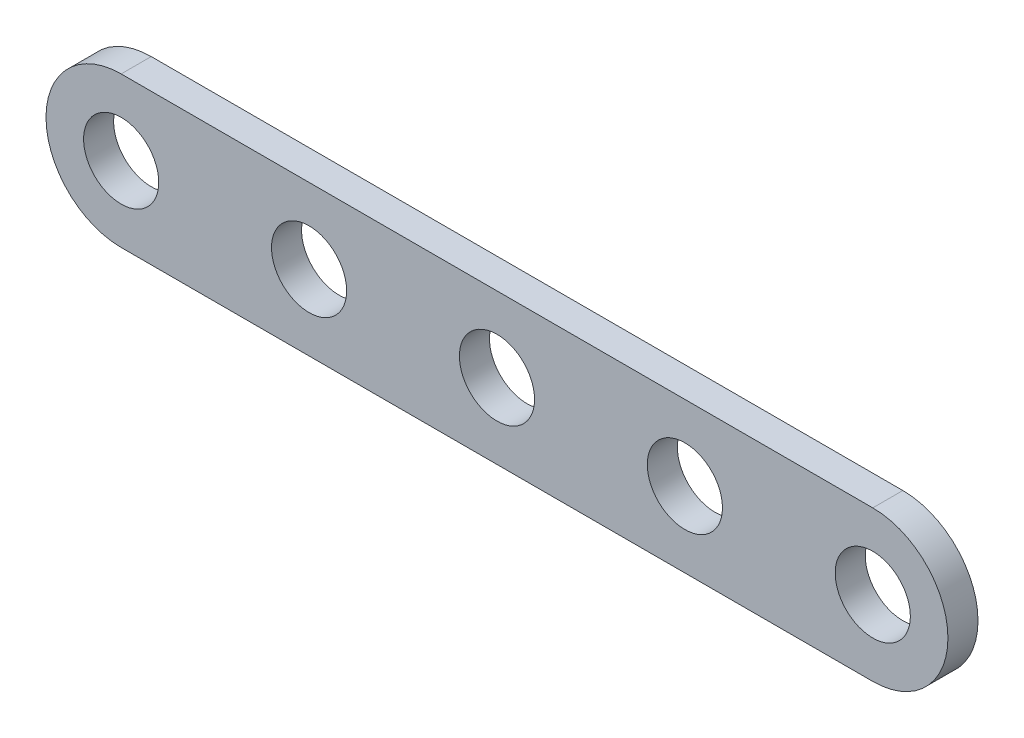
ISO-10303-21;
HEADER;
FILE_DESCRIPTION(('STEP AP214'),'2;1');
FILE_NAME('part.step','',(''),(''),'','','');
FILE_SCHEMA(('AUTOMOTIVE_DESIGN { 1 0 10303 214 1 1 1 1 }'));
ENDSEC;
DATA;
#1=APPLICATION_CONTEXT('core data for automotive mechanical design processes');
#2=APPLICATION_PROTOCOL_DEFINITION('international standard','automotive_design',2000,#1);
#3=PRODUCT_CONTEXT('',#1,'mechanical');
#4=PRODUCT('Part','Part','',(#3));
#5=PRODUCT_RELATED_PRODUCT_CATEGORY('part','',(#4));
#6=PRODUCT_DEFINITION_FORMATION('','',#4);
#7=PRODUCT_DEFINITION_CONTEXT('part definition',#1,'design');
#8=PRODUCT_DEFINITION('design','',#6,#7);
#9=PRODUCT_DEFINITION_SHAPE('','',#8);
#10=(LENGTH_UNIT() NAMED_UNIT(*) SI_UNIT(.MILLI.,.METRE.));
#11=(NAMED_UNIT(*) PLANE_ANGLE_UNIT() SI_UNIT($,.RADIAN.));
#12=(NAMED_UNIT(*) SI_UNIT($,.STERADIAN.) SOLID_ANGLE_UNIT());
#13=UNCERTAINTY_MEASURE_WITH_UNIT(LENGTH_MEASURE(1.E-05),#10,'distance_accuracy_value','');
#14=(GEOMETRIC_REPRESENTATION_CONTEXT(3) GLOBAL_UNCERTAINTY_ASSIGNED_CONTEXT((#13)) GLOBAL_UNIT_ASSIGNED_CONTEXT((#10,
#11,#12)) REPRESENTATION_CONTEXT('',''));
#15=CARTESIAN_POINT('',(0.,0.,0.));
#16=DIRECTION('',(0.,0.,1.));
#17=DIRECTION('',(1.,0.,0.));
#18=AXIS2_PLACEMENT_3D('',#15,#16,#17);
#19=CARTESIAN_POINT('',(0.,50.,10.));
#20=DIRECTION('',(0.,0.,-1.));
#21=DIRECTION('',(-1.,0.,0.));
#22=AXIS2_PLACEMENT_3D('',#19,#20,#21);
#23=CYLINDRICAL_SURFACE('',#22,50.);
#24=CARTESIAN_POINT('',(0.,50.,-10.));
#25=DIRECTION('',(0.,0.,1.));
#26=DIRECTION('',(1.,0.,0.));
#27=AXIS2_PLACEMENT_3D('',#24,#25,#26);
#28=CIRCLE('',#27,50.);
#29=CARTESIAN_POINT('',(0.,100.,-10.));
#30=VERTEX_POINT('',#29);
#31=CARTESIAN_POINT('',(0.,0.,-10.));
#32=VERTEX_POINT('',#31);
#33=EDGE_CURVE('E97',#30,#32,#28,.T.);
#34=ORIENTED_EDGE('',*,*,#33,.T.);
#35=DIRECTION('',(0.,0.,-1.));
#36=VECTOR('',#35,1.);
#37=CARTESIAN_POINT('',(0.,0.,10.));
#38=LINE('',#37,#36);
#39=CARTESIAN_POINT('',(0.,0.,10.));
#40=VERTEX_POINT('',#39);
#41=EDGE_CURVE('E11',#40,#32,#38,.T.);
#42=ORIENTED_EDGE('',*,*,#41,.F.);
#43=CARTESIAN_POINT('',(0.,50.,10.));
#44=DIRECTION('',(0.,0.,1.));
#45=DIRECTION('',(1.,0.,0.));
#46=AXIS2_PLACEMENT_3D('',#43,#44,#45);
#47=CIRCLE('',#46,50.);
#48=CARTESIAN_POINT('',(0.,100.,10.));
#49=VERTEX_POINT('',#48);
#50=EDGE_CURVE('E85',#49,#40,#47,.T.);
#51=ORIENTED_EDGE('',*,*,#50,.F.);
#52=DIRECTION('',(0.,0.,-1.));
#53=VECTOR('',#52,1.);
#54=CARTESIAN_POINT('',(0.,100.,10.));
#55=LINE('',#54,#53);
#56=EDGE_CURVE('E93',#49,#30,#55,.T.);
#57=ORIENTED_EDGE('',*,*,#56,.T.);
#58=EDGE_LOOP('',(#34,#42,#51,#57));
#59=FACE_BOUND('',#58,.T.);
#60=ADVANCED_FACE('F34',(#59),#23,.T.);
#61=CARTESIAN_POINT('',(0.,0.,10.));
#62=DIRECTION('',(0.,1.,0.));
#63=DIRECTION('',(0.,0.,1.));
#64=AXIS2_PLACEMENT_3D('',#61,#62,#63);
#65=PLANE('',#64);
#66=DIRECTION('',(1.,0.,0.));
#67=VECTOR('',#66,1.);
#68=CARTESIAN_POINT('',(0.,0.,-10.));
#69=LINE('',#68,#67);
#70=CARTESIAN_POINT('',(500.,0.,-10.));
#71=VERTEX_POINT('',#70);
#72=EDGE_CURVE('E89',#32,#71,#69,.T.);
#73=ORIENTED_EDGE('',*,*,#72,.T.);
#74=DIRECTION('',(0.,0.,-1.));
#75=VECTOR('',#74,1.);
#76=CARTESIAN_POINT('',(500.,0.,10.));
#77=LINE('',#76,#75);
#78=CARTESIAN_POINT('',(500.,0.,10.));
#79=VERTEX_POINT('',#78);
#80=EDGE_CURVE('E42',#79,#71,#77,.T.);
#81=ORIENTED_EDGE('',*,*,#80,.F.);
#82=DIRECTION('',(1.,0.,0.));
#83=VECTOR('',#82,1.);
#84=CARTESIAN_POINT('',(0.,0.,10.));
#85=LINE('',#84,#83);
#86=EDGE_CURVE('E80',#40,#79,#85,.T.);
#87=ORIENTED_EDGE('',*,*,#86,.F.);
#88=ORIENTED_EDGE('',*,*,#41,.T.);
#89=EDGE_LOOP('',(#73,#81,#87,#88));
#90=FACE_BOUND('',#89,.T.);
#91=ADVANCED_FACE('F88',(#90),#65,.F.);
#92=CARTESIAN_POINT('',(500.,50.,10.));
#93=DIRECTION('',(0.,0.,-1.));
#94=DIRECTION('',(-1.,0.,0.));
#95=AXIS2_PLACEMENT_3D('',#92,#93,#94);
#96=CYLINDRICAL_SURFACE('',#95,50.);
#97=CARTESIAN_POINT('',(500.,50.,-10.));
#98=DIRECTION('',(0.,0.,1.));
#99=DIRECTION('',(-1.,0.,0.));
#100=AXIS2_PLACEMENT_3D('',#97,#98,#99);
#101=CIRCLE('',#100,50.);
#102=CARTESIAN_POINT('',(500.,100.,-10.));
#103=VERTEX_POINT('',#102);
#104=EDGE_CURVE('E67',#71,#103,#101,.T.);
#105=ORIENTED_EDGE('',*,*,#104,.T.);
#106=DIRECTION('',(0.,0.,-1.));
#107=VECTOR('',#106,1.);
#108=CARTESIAN_POINT('',(500.,100.,10.));
#109=LINE('',#108,#107);
#110=CARTESIAN_POINT('',(500.,100.,10.));
#111=VERTEX_POINT('',#110);
#112=EDGE_CURVE('E90',#111,#103,#109,.T.);
#113=ORIENTED_EDGE('',*,*,#112,.F.);
#114=CARTESIAN_POINT('',(500.,50.,10.));
#115=DIRECTION('',(0.,0.,1.));
#116=DIRECTION('',(-1.,0.,0.));
#117=AXIS2_PLACEMENT_3D('',#114,#115,#116);
#118=CIRCLE('',#117,50.);
#119=EDGE_CURVE('E83',#79,#111,#118,.T.);
#120=ORIENTED_EDGE('',*,*,#119,.F.);
#121=ORIENTED_EDGE('',*,*,#80,.T.);
#122=EDGE_LOOP('',(#105,#113,#120,#121));
#123=FACE_BOUND('',#122,.T.);
#124=ADVANCED_FACE('F91',(#123),#96,.T.);
#125=CARTESIAN_POINT('',(0.,100.,10.));
#126=DIRECTION('',(0.,-1.,0.));
#127=DIRECTION('',(0.,0.,-1.));
#128=AXIS2_PLACEMENT_3D('',#125,#126,#127);
#129=PLANE('',#128);
#130=DIRECTION('',(-1.,0.,0.));
#131=VECTOR('',#130,1.);
#132=CARTESIAN_POINT('',(0.,100.,-10.));
#133=LINE('',#132,#131);
#134=EDGE_CURVE('E73',#103,#30,#133,.T.);
#135=ORIENTED_EDGE('',*,*,#134,.T.);
#136=ORIENTED_EDGE('',*,*,#56,.F.);
#137=DIRECTION('',(-1.,0.,0.));
#138=VECTOR('',#137,1.);
#139=CARTESIAN_POINT('',(0.,100.,10.));
#140=LINE('',#139,#138);
#141=EDGE_CURVE('E50',#111,#49,#140,.T.);
#142=ORIENTED_EDGE('',*,*,#141,.F.);
#143=ORIENTED_EDGE('',*,*,#112,.T.);
#144=EDGE_LOOP('',(#135,#136,#142,#143));
#145=FACE_BOUND('',#144,.T.);
#146=ADVANCED_FACE('F105',(#145),#129,.F.);
#147=CARTESIAN_POINT('',(0.,50.,10.));
#148=DIRECTION('',(0.,0.,1.));
#149=DIRECTION('',(1.,0.,0.));
#150=AXIS2_PLACEMENT_3D('',#147,#148,#149);
#151=PLANE('',#150);
#152=CARTESIAN_POINT('',(500.,50.,10.));
#153=DIRECTION('',(0.,0.,1.));
#154=DIRECTION('',(1.,0.,0.));
#155=AXIS2_PLACEMENT_3D('',#152,#153,#154);
#156=CIRCLE('',#155,25.);
#157=CARTESIAN_POINT('',(525.,50.,10.));
#158=VERTEX_POINT('',#157);
#159=EDGE_CURVE('E135',#158,#158,#156,.T.);
#160=ORIENTED_EDGE('',*,*,#159,.F.);
#161=EDGE_LOOP('',(#160));
#162=FACE_BOUND('',#161,.T.);
#163=CARTESIAN_POINT('',(375.,50.,10.));
#164=DIRECTION('',(0.,0.,1.));
#165=DIRECTION('',(1.,0.,0.));
#166=AXIS2_PLACEMENT_3D('',#163,#164,#165);
#167=CIRCLE('',#166,25.);
#168=CARTESIAN_POINT('',(400.,50.,10.));
#169=VERTEX_POINT('',#168);
#170=EDGE_CURVE('E129',#169,#169,#167,.T.);
#171=ORIENTED_EDGE('',*,*,#170,.F.);
#172=EDGE_LOOP('',(#171));
#173=FACE_BOUND('',#172,.T.);
#174=CARTESIAN_POINT('',(250.,50.,10.));
#175=DIRECTION('',(0.,0.,1.));
#176=DIRECTION('',(1.,0.,0.));
#177=AXIS2_PLACEMENT_3D('',#174,#175,#176);
#178=CIRCLE('',#177,25.);
#179=CARTESIAN_POINT('',(275.,50.,10.));
#180=VERTEX_POINT('',#179);
#181=EDGE_CURVE('E123',#180,#180,#178,.T.);
#182=ORIENTED_EDGE('',*,*,#181,.F.);
#183=EDGE_LOOP('',(#182));
#184=FACE_BOUND('',#183,.T.);
#185=CARTESIAN_POINT('',(125.,50.,10.));
#186=DIRECTION('',(0.,0.,1.));
#187=DIRECTION('',(1.,0.,0.));
#188=AXIS2_PLACEMENT_3D('',#185,#186,#187);
#189=CIRCLE('',#188,25.);
#190=CARTESIAN_POINT('',(150.,50.,10.));
#191=VERTEX_POINT('',#190);
#192=EDGE_CURVE('E117',#191,#191,#189,.T.);
#193=ORIENTED_EDGE('',*,*,#192,.F.);
#194=EDGE_LOOP('',(#193));
#195=FACE_BOUND('',#194,.T.);
#196=CARTESIAN_POINT('',(0.,50.,10.));
#197=DIRECTION('',(0.,0.,1.));
#198=DIRECTION('',(1.,0.,0.));
#199=AXIS2_PLACEMENT_3D('',#196,#197,#198);
#200=CIRCLE('',#199,25.);
#201=CARTESIAN_POINT('',(25.,50.,10.));
#202=VERTEX_POINT('',#201);
#203=EDGE_CURVE('E111',#202,#202,#200,.T.);
#204=ORIENTED_EDGE('',*,*,#203,.F.);
#205=EDGE_LOOP('',(#204));
#206=FACE_BOUND('',#205,.T.);
#207=ORIENTED_EDGE('',*,*,#50,.T.);
#208=ORIENTED_EDGE('',*,*,#86,.T.);
#209=ORIENTED_EDGE('',*,*,#119,.T.);
#210=ORIENTED_EDGE('',*,*,#141,.T.);
#211=EDGE_LOOP('',(#207,#208,#209,#210));
#212=FACE_BOUND('',#211,.T.);
#213=ADVANCED_FACE('F81',(#162,#173,#184,#195,#206,#212),#151,.T.);
#214=CARTESIAN_POINT('',(0.,50.,-10.));
#215=DIRECTION('',(0.,0.,1.));
#216=DIRECTION('',(1.,0.,0.));
#217=AXIS2_PLACEMENT_3D('',#214,#215,#216);
#218=PLANE('',#217);
#219=CARTESIAN_POINT('',(500.,50.,-10.));
#220=DIRECTION('',(0.,0.,1.));
#221=DIRECTION('',(1.,0.,0.));
#222=AXIS2_PLACEMENT_3D('',#219,#220,#221);
#223=CIRCLE('',#222,25.);
#224=CARTESIAN_POINT('',(525.,50.,-10.));
#225=VERTEX_POINT('',#224);
#226=EDGE_CURVE('E132',#225,#225,#223,.T.);
#227=ORIENTED_EDGE('',*,*,#226,.T.);
#228=EDGE_LOOP('',(#227));
#229=FACE_BOUND('',#228,.T.);
#230=CARTESIAN_POINT('',(375.,50.,-10.));
#231=DIRECTION('',(0.,0.,1.));
#232=DIRECTION('',(1.,0.,0.));
#233=AXIS2_PLACEMENT_3D('',#230,#231,#232);
#234=CIRCLE('',#233,25.);
#235=CARTESIAN_POINT('',(400.,50.,-10.));
#236=VERTEX_POINT('',#235);
#237=EDGE_CURVE('E126',#236,#236,#234,.T.);
#238=ORIENTED_EDGE('',*,*,#237,.T.);
#239=EDGE_LOOP('',(#238));
#240=FACE_BOUND('',#239,.T.);
#241=CARTESIAN_POINT('',(250.,50.,-10.));
#242=DIRECTION('',(0.,0.,1.));
#243=DIRECTION('',(1.,0.,0.));
#244=AXIS2_PLACEMENT_3D('',#241,#242,#243);
#245=CIRCLE('',#244,25.);
#246=CARTESIAN_POINT('',(275.,50.,-10.));
#247=VERTEX_POINT('',#246);
#248=EDGE_CURVE('E120',#247,#247,#245,.T.);
#249=ORIENTED_EDGE('',*,*,#248,.T.);
#250=EDGE_LOOP('',(#249));
#251=FACE_BOUND('',#250,.T.);
#252=CARTESIAN_POINT('',(125.,50.,-10.));
#253=DIRECTION('',(0.,0.,1.));
#254=DIRECTION('',(1.,0.,0.));
#255=AXIS2_PLACEMENT_3D('',#252,#253,#254);
#256=CIRCLE('',#255,25.);
#257=CARTESIAN_POINT('',(150.,50.,-10.));
#258=VERTEX_POINT('',#257);
#259=EDGE_CURVE('E114',#258,#258,#256,.T.);
#260=ORIENTED_EDGE('',*,*,#259,.T.);
#261=EDGE_LOOP('',(#260));
#262=FACE_BOUND('',#261,.T.);
#263=CARTESIAN_POINT('',(0.,50.,-10.));
#264=DIRECTION('',(0.,0.,1.));
#265=DIRECTION('',(1.,0.,0.));
#266=AXIS2_PLACEMENT_3D('',#263,#264,#265);
#267=CIRCLE('',#266,25.);
#268=CARTESIAN_POINT('',(25.,50.,-10.));
#269=VERTEX_POINT('',#268);
#270=EDGE_CURVE('E100',#269,#269,#267,.T.);
#271=ORIENTED_EDGE('',*,*,#270,.T.);
#272=EDGE_LOOP('',(#271));
#273=FACE_BOUND('',#272,.T.);
#274=ORIENTED_EDGE('',*,*,#33,.F.);
#275=ORIENTED_EDGE('',*,*,#134,.F.);
#276=ORIENTED_EDGE('',*,*,#104,.F.);
#277=ORIENTED_EDGE('',*,*,#72,.F.);
#278=EDGE_LOOP('',(#274,#275,#276,#277));
#279=FACE_BOUND('',#278,.T.);
#280=ADVANCED_FACE('F108',(#229,#240,#251,#262,#273,#279),#218,.F.);
#281=CARTESIAN_POINT('',(0.,50.,-10.));
#282=DIRECTION('',(0.,0.,1.));
#283=DIRECTION('',(1.,0.,0.));
#284=AXIS2_PLACEMENT_3D('',#281,#282,#283);
#285=CYLINDRICAL_SURFACE('',#284,25.);
#286=ORIENTED_EDGE('',*,*,#270,.F.);
#287=EDGE_LOOP('',(#286));
#288=FACE_BOUND('',#287,.T.);
#289=ORIENTED_EDGE('',*,*,#203,.T.);
#290=EDGE_LOOP('',(#289));
#291=FACE_BOUND('',#290,.T.);
#292=ADVANCED_FACE('F161',(#288,#291),#285,.F.);
#293=CARTESIAN_POINT('',(125.,50.,-10.));
#294=DIRECTION('',(0.,0.,1.));
#295=DIRECTION('',(1.,0.,0.));
#296=AXIS2_PLACEMENT_3D('',#293,#294,#295);
#297=CYLINDRICAL_SURFACE('',#296,25.);
#298=ORIENTED_EDGE('',*,*,#259,.F.);
#299=EDGE_LOOP('',(#298));
#300=FACE_BOUND('',#299,.T.);
#301=ORIENTED_EDGE('',*,*,#192,.T.);
#302=EDGE_LOOP('',(#301));
#303=FACE_BOUND('',#302,.T.);
#304=ADVANCED_FACE('F163',(#300,#303),#297,.F.);
#305=CARTESIAN_POINT('',(250.,50.,-10.));
#306=DIRECTION('',(0.,0.,1.));
#307=DIRECTION('',(1.,0.,0.));
#308=AXIS2_PLACEMENT_3D('',#305,#306,#307);
#309=CYLINDRICAL_SURFACE('',#308,25.);
#310=ORIENTED_EDGE('',*,*,#248,.F.);
#311=EDGE_LOOP('',(#310));
#312=FACE_BOUND('',#311,.T.);
#313=ORIENTED_EDGE('',*,*,#181,.T.);
#314=EDGE_LOOP('',(#313));
#315=FACE_BOUND('',#314,.T.);
#316=ADVANCED_FACE('F170',(#312,#315),#309,.F.);
#317=CARTESIAN_POINT('',(375.,50.,-10.));
#318=DIRECTION('',(0.,0.,1.));
#319=DIRECTION('',(1.,0.,0.));
#320=AXIS2_PLACEMENT_3D('',#317,#318,#319);
#321=CYLINDRICAL_SURFACE('',#320,25.);
#322=ORIENTED_EDGE('',*,*,#237,.F.);
#323=EDGE_LOOP('',(#322));
#324=FACE_BOUND('',#323,.T.);
#325=ORIENTED_EDGE('',*,*,#170,.T.);
#326=EDGE_LOOP('',(#325));
#327=FACE_BOUND('',#326,.T.);
#328=ADVANCED_FACE('F146',(#324,#327),#321,.F.);
#329=CARTESIAN_POINT('',(500.,50.,-10.));
#330=DIRECTION('',(0.,0.,1.));
#331=DIRECTION('',(1.,0.,0.));
#332=AXIS2_PLACEMENT_3D('',#329,#330,#331);
#333=CYLINDRICAL_SURFACE('',#332,25.);
#334=ORIENTED_EDGE('',*,*,#226,.F.);
#335=EDGE_LOOP('',(#334));
#336=FACE_BOUND('',#335,.T.);
#337=ORIENTED_EDGE('',*,*,#159,.T.);
#338=EDGE_LOOP('',(#337));
#339=FACE_BOUND('',#338,.T.);
#340=ADVANCED_FACE('F143',(#336,#339),#333,.F.);
#341=CLOSED_SHELL('',(#60,#91,#124,#146,#213,#280,#292,#304,#316,#328,#340));
#342=MANIFOLD_SOLID_BREP('B2',#341);
#343=ADVANCED_BREP_SHAPE_REPRESENTATION('',(#18,#342),#14);
#344=SHAPE_DEFINITION_REPRESENTATION(#9,#343);
ENDSEC;
END-ISO-10303-21;
